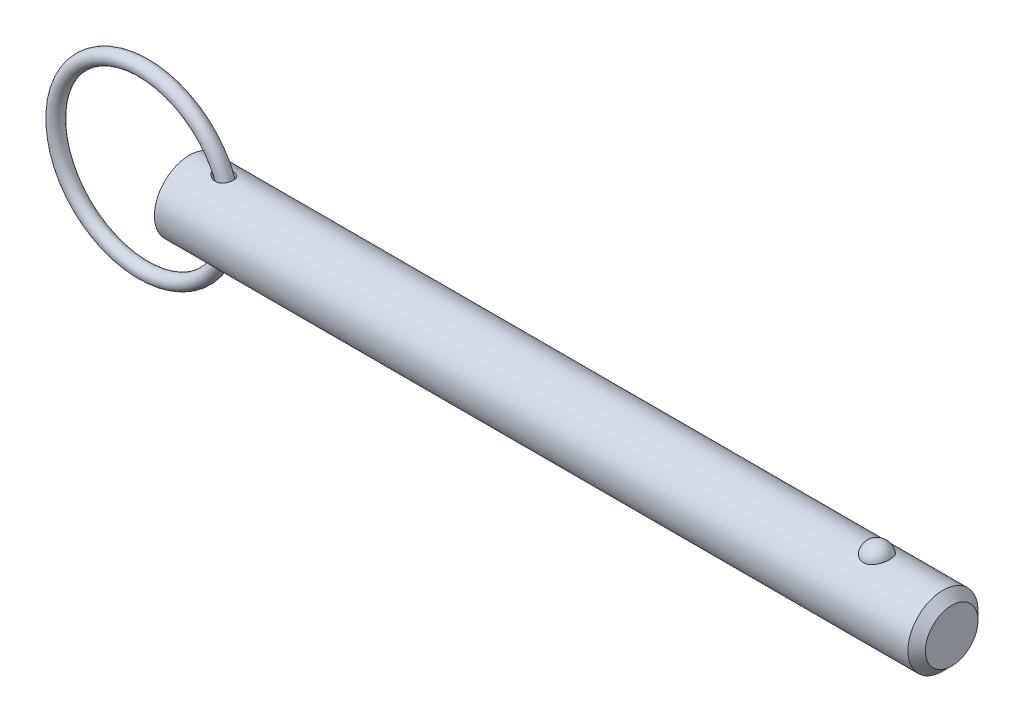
ISO-10303-21;
HEADER;
FILE_DESCRIPTION(('STEP AP214'),'2;1');
FILE_NAME('part.step','',(''),(''),'','','');
FILE_SCHEMA(('AUTOMOTIVE_DESIGN { 1 0 10303 214 1 1 1 1 }'));
ENDSEC;
DATA;
#1=APPLICATION_CONTEXT('core data for automotive mechanical design processes');
#2=APPLICATION_PROTOCOL_DEFINITION('international standard','automotive_design',2000,#1);
#3=PRODUCT_CONTEXT('',#1,'mechanical');
#4=PRODUCT('Part','Part','',(#3));
#5=PRODUCT_RELATED_PRODUCT_CATEGORY('part','',(#4));
#6=PRODUCT_DEFINITION_FORMATION('','',#4);
#7=PRODUCT_DEFINITION_CONTEXT('part definition',#1,'design');
#8=PRODUCT_DEFINITION('design','',#6,#7);
#9=PRODUCT_DEFINITION_SHAPE('','',#8);
#10=(LENGTH_UNIT() NAMED_UNIT(*) SI_UNIT(.MILLI.,.METRE.));
#11=(NAMED_UNIT(*) PLANE_ANGLE_UNIT() SI_UNIT($,.RADIAN.));
#12=(NAMED_UNIT(*) SI_UNIT($,.STERADIAN.) SOLID_ANGLE_UNIT());
#13=UNCERTAINTY_MEASURE_WITH_UNIT(LENGTH_MEASURE(1.E-05),#10,'distance_accuracy_value','');
#14=(GEOMETRIC_REPRESENTATION_CONTEXT(3) GLOBAL_UNCERTAINTY_ASSIGNED_CONTEXT((#13)) GLOBAL_UNIT_ASSIGNED_CONTEXT((#10,
#11,#12)) REPRESENTATION_CONTEXT('',''));
#15=CARTESIAN_POINT('',(0.,0.,0.));
#16=DIRECTION('',(0.,0.,1.));
#17=DIRECTION('',(1.,0.,0.));
#18=AXIS2_PLACEMENT_3D('',#15,#16,#17);
#19=CARTESIAN_POINT('',(-8.34703434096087,0.,0.));
#20=DIRECTION('',(0.,0.,1.));
#21=DIRECTION('',(1.,0.,0.));
#22=AXIS2_PLACEMENT_3D('',#19,#20,#21);
#23=TOROIDAL_SURFACE('',#22,15.875,1.27);
#24=CARTESIAN_POINT('',(8.79796565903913,0.,0.));
#25=VERTEX_POINT('',#24);
#26=VERTEX_LOOP('',#25);
#27=FACE_BOUND('',#26,.T.);
#28=ADVANCED_FACE('P0_F12',(#27),#23,.T.);
#29=CLOSED_SHELL('',(#28));
#30=MANIFOLD_SOLID_BREP('P0_B1',#29);
#31=CARTESIAN_POINT('',(0.,0.,0.));
#32=DIRECTION('',(1.,0.,0.));
#33=DIRECTION('',(0.,0.,-1.));
#34=AXIS2_PLACEMENT_3D('',#31,#32,#33);
#35=CYLINDRICAL_SURFACE('',#34,6.35);
#36=CARTESIAN_POINT('',(4.87230670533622,6.27273159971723,-0.987592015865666));
#37=CARTESIAN_POINT('',(4.94734735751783,6.26035058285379,-1.06623378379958));
#38=CARTESIAN_POINT('',(5.02968768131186,6.24755813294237,-1.13788608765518));
#39=CARTESIAN_POINT('',(5.2053426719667,6.22278258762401,-1.26640223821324));
#40=CARTESIAN_POINT('',(5.29867273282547,6.21080066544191,-1.32324497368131));
#41=CARTESIAN_POINT('',(5.49318962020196,6.18912414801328,-1.42117930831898));
#42=CARTESIAN_POINT('',(5.59435470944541,6.17942350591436,-1.46231273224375));
#43=CARTESIAN_POINT('',(5.80219659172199,6.16352555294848,-1.52793951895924));
#44=CARTESIAN_POINT('',(5.90887152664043,6.15732706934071,-1.55243845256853));
#45=CARTESIAN_POINT('',(6.12818220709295,6.14931784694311,-1.58387975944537));
#46=CARTESIAN_POINT('',(6.24090110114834,6.14763959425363,-1.59029227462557));
#47=CARTESIAN_POINT('',(6.46560233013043,6.14965588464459,-1.58248630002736));
#48=CARTESIAN_POINT('',(6.57758514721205,6.15334646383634,-1.56828303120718));
#49=CARTESIAN_POINT('',(6.78516594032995,6.1652116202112,-1.52091398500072));
#50=CARTESIAN_POINT('',(6.88126802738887,6.17288876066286,-1.48983713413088));
#51=CARTESIAN_POINT('',(7.06576629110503,6.19149190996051,-1.41052329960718));
#52=CARTESIAN_POINT('',(7.15416739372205,6.20241582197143,-1.36229738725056));
#53=CARTESIAN_POINT('',(7.31166929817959,6.2248616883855,-1.25548983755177));
#54=CARTESIAN_POINT('',(7.3818144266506,6.23621734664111,-1.19840625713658));
#55=CARTESIAN_POINT('',(7.51101296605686,6.259037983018,-1.07284763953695));
#56=CARTESIAN_POINT('',(7.57006844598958,6.2705029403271,-1.00437473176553));
#57=CARTESIAN_POINT('',(7.6737469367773,6.29184873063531,-0.860384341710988));
#58=CARTESIAN_POINT('',(7.71876694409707,6.30176816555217,-0.785157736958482));
#59=CARTESIAN_POINT('',(7.79574491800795,6.31935829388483,-0.628053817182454));
#60=CARTESIAN_POINT('',(7.82770308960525,6.32702902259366,-0.546176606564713));
#61=CARTESIAN_POINT('',(7.87788845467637,6.33930929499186,-0.377876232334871));
#62=CARTESIAN_POINT('',(7.89608106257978,6.34391112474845,-0.291442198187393));
#63=CARTESIAN_POINT('',(7.9182072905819,6.34953044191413,-0.116652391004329));
#64=CARTESIAN_POINT('',(7.92214044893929,6.35054781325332,-0.0282965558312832));
#65=CARTESIAN_POINT('',(7.91564686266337,6.34888556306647,0.148263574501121));
#66=CARTESIAN_POINT('',(7.90515337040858,6.34618875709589,0.236465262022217));
#67=CARTESIAN_POINT('',(7.8699153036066,6.33735741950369,0.409798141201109));
#68=CARTESIAN_POINT('',(7.84517062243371,6.33122286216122,0.494929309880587));
#69=CARTESIAN_POINT('',(7.7819985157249,6.31618517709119,0.659657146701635));
#70=CARTESIAN_POINT('',(7.74357645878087,6.30728313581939,0.739255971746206));
#71=CARTESIAN_POINT('',(7.65396632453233,6.28769050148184,0.890663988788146));
#72=CARTESIAN_POINT('',(7.60277911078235,6.27700002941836,0.962473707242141));
#73=CARTESIAN_POINT('',(7.48925881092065,6.2550822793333,1.09590260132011));
#74=CARTESIAN_POINT('',(7.42698604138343,6.24385813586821,1.15757361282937));
#75=CARTESIAN_POINT('',(7.29283556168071,6.2220655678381,1.26951234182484));
#76=CARTESIAN_POINT('',(7.22095880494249,6.21149707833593,1.31978118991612));
#77=CARTESIAN_POINT('',(7.06971853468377,6.19216002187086,1.40772509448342));
#78=CARTESIAN_POINT('',(6.99035873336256,6.18339056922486,1.44540635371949));
#79=CARTESIAN_POINT('',(6.82642723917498,6.16851603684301,1.50762653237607));
#80=CARTESIAN_POINT('',(6.7418548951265,6.16241129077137,1.53216380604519));
#81=CARTESIAN_POINT('',(6.56686412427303,6.15321474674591,1.56869994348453));
#82=CARTESIAN_POINT('',(6.47634467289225,6.15023369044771,1.58023897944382));
#83=CARTESIAN_POINT('',(6.29456956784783,6.14778331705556,1.58974172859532));
#84=CARTESIAN_POINT('',(6.20331368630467,6.1483151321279,1.58770106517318));
#85=CARTESIAN_POINT('',(6.01385969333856,6.15284811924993,1.5700487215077));
#86=CARTESIAN_POINT('',(5.91578322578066,6.15715979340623,1.55322212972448));
#87=CARTESIAN_POINT('',(5.72331909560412,6.16902415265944,1.5054032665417));
#88=CARTESIAN_POINT('',(5.6289344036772,6.17657939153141,1.4743998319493));
#89=CARTESIAN_POINT('',(5.4357260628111,6.19502494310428,1.39499475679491));
#90=CARTESIAN_POINT('',(5.33755891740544,6.20619097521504,1.34505268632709));
#91=CARTESIAN_POINT('',(5.15090047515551,6.23006191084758,1.22975103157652));
#92=CARTESIAN_POINT('',(5.06240741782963,6.24276653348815,1.16439425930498));
#93=CARTESIAN_POINT('',(4.91171642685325,6.26607433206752,1.03083814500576));
#94=CARTESIAN_POINT('',(4.84758224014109,6.27668356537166,0.964825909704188));
#95=CARTESIAN_POINT('',(4.73090054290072,6.29683133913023,0.823112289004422));
#96=CARTESIAN_POINT('',(4.67833688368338,6.30637136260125,0.747424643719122));
#97=CARTESIAN_POINT('',(4.59543145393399,6.32183254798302,0.601150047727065));
#98=CARTESIAN_POINT('',(4.56283099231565,6.32809321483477,0.531883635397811));
#99=CARTESIAN_POINT('',(4.50941370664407,6.33849198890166,0.388778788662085));
#100=CARTESIAN_POINT('',(4.48858876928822,6.34263155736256,0.314943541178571));
#101=CARTESIAN_POINT('',(4.46008864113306,6.3483236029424,0.164282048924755));
#102=CARTESIAN_POINT('',(4.45247558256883,6.34986385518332,0.08744340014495));
#103=CARTESIAN_POINT('',(4.45121096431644,6.35011863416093,-0.0663538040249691));
#104=CARTESIAN_POINT('',(4.45755802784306,6.34883343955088,-0.143312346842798));
#105=CARTESIAN_POINT('',(4.48267656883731,6.34380948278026,-0.288945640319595));
#106=CARTESIAN_POINT('',(4.50045680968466,6.34026665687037,-0.357802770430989));
#107=CARTESIAN_POINT('',(4.54636050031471,6.33128211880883,-0.491815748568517));
#108=CARTESIAN_POINT('',(4.57448566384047,6.32584009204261,-0.556970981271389));
#109=CARTESIAN_POINT('',(4.64209700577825,6.31308107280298,-0.687092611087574));
#110=CARTESIAN_POINT('',(4.68226903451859,6.30565525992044,-0.751689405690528));
#111=CARTESIAN_POINT('',(4.77120834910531,6.28979741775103,-0.874524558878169));
#112=CARTESIAN_POINT('',(4.81998302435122,6.28136452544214,-0.932757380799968));
#113=CARTESIAN_POINT('',(4.87230670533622,6.27273159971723,-0.987592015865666));
#114=B_SPLINE_CURVE_WITH_KNOTS('',3,(#36,#37,#38,#39,#40,#41,#42,#43,#44,#45,#46,#47,#48,#49,
#50,#51,#52,#53,#54,#55,#56,#57,#58,#59,#60,#61,#62,#63,#64,#65,#66,#67,#68,#69,#70,#71,#72,#73,
#74,#75,#76,#77,#78,#79,#80,#81,#82,#83,#84,#85,#86,#87,#88,#89,#90,#91,#92,#93,#94,#95,#96,#97,
#98,#99,#100,#101,#102,#103,#104,#105,#106,#107,#108,#109,#110,#111,#112,#113),.UNSPECIFIED.,
.T.,.F.,(4,2,2,2,2,2,2,2,2,2,2,2,2,2,2,2,2,2,2,2,2,2,2,2,2,2,2,2,2,2,2,2,2,2,2,2,2,2,4),(0.,
0.327902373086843,0.65626964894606,0.983756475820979,1.31113357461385,1.64800657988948,
1.98463099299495,2.28681225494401,2.58879878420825,2.86088594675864,3.13292229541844,
3.3963648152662,3.65980320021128,3.92390128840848,4.18800792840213,4.45334062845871,
4.7186753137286,4.98390596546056,5.24911867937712,5.51293017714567,5.7767155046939,
6.04037065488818,6.30405880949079,6.57680801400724,6.84964512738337,7.14724526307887,
7.44508014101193,7.77572668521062,8.10631295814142,8.38318772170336,8.65967357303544,
8.88915303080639,9.11847418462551,9.34887088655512,9.57924486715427,9.79193291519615,
10.0046562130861,10.2330958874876,10.4617327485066),.UNSPECIFIED.);
#115=CARTESIAN_POINT('',(4.87230670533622,6.27273159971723,-0.987592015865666));
#116=VERTEX_POINT('',#115);
#117=EDGE_CURVE('P1_E40',#116,#116,#114,.T.);
#118=ORIENTED_EDGE('',*,*,#117,.T.);
#119=EDGE_LOOP('',(#118));
#120=FACE_BOUND('',#119,.T.);
#121=CARTESIAN_POINT('',(136.5125,0.,0.));
#122=DIRECTION('',(1.,0.,0.));
#123=DIRECTION('',(0.,0.,-1.));
#124=AXIS2_PLACEMENT_3D('',#121,#122,#123);
#125=CIRCLE('',#124,6.35);
#126=CARTESIAN_POINT('',(136.5125,0.,-6.35));
#127=VERTEX_POINT('',#126);
#128=EDGE_CURVE('P1_E25',#127,#127,#125,.T.);
#129=ORIENTED_EDGE('',*,*,#128,.F.);
#130=EDGE_LOOP('',(#129));
#131=FACE_BOUND('',#130,.T.);
#132=CARTESIAN_POINT('',(0.,0.,0.));
#133=DIRECTION('',(1.,0.,0.));
#134=DIRECTION('',(0.,0.,-1.));
#135=AXIS2_PLACEMENT_3D('',#132,#133,#134);
#136=CIRCLE('',#135,6.35);
#137=CARTESIAN_POINT('',(0.,0.,-6.35));
#138=VERTEX_POINT('',#137);
#139=EDGE_CURVE('P1_E9',#138,#138,#136,.T.);
#140=ORIENTED_EDGE('',*,*,#139,.T.);
#141=EDGE_LOOP('',(#140));
#142=FACE_BOUND('',#141,.T.);
#143=CARTESIAN_POINT('',(124.550021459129,5.87502187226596,2.40969251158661));
#144=CARTESIAN_POINT('',(124.425030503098,5.87501645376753,2.40969773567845));
#145=CARTESIAN_POINT('',(124.300080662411,5.87916061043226,2.39967292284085));
#146=CARTESIAN_POINT('',(124.053909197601,5.8952311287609,2.35991730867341));
#147=CARTESIAN_POINT('',(123.932686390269,5.90715499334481,2.33019283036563));
#148=CARTESIAN_POINT('',(123.697517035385,5.93739567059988,2.252014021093));
#149=CARTESIAN_POINT('',(123.583560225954,5.95570321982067,2.20358681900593));
#150=CARTESIAN_POINT('',(123.36557352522,5.9967206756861,2.08937987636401));
#151=CARTESIAN_POINT('',(123.261545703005,6.0194314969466,2.02359652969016));
#152=CARTESIAN_POINT('',(123.062943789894,6.06760647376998,1.87428969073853));
#153=CARTESIAN_POINT('',(122.968726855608,6.09313095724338,1.79031110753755));
#154=CARTESIAN_POINT('',(122.795255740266,6.14375873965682,1.60800178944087));
#155=CARTESIAN_POINT('',(122.716004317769,6.16886196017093,1.50966841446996));
#156=CARTESIAN_POINT('',(122.570845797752,6.21724600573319,1.29645884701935));
#157=CARTESIAN_POINT('',(122.505688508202,6.24039621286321,1.18104158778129));
#158=CARTESIAN_POINT('',(122.394703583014,6.28117277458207,0.940351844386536));
#159=CARTESIAN_POINT('',(122.348877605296,6.29879865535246,0.815078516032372));
#160=CARTESIAN_POINT('',(122.277023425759,6.32692073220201,0.556494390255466));
#161=CARTESIAN_POINT('',(122.251249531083,6.33732517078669,0.423102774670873));
#162=CARTESIAN_POINT('',(122.220988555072,6.34957673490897,0.153542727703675));
#163=CARTESIAN_POINT('',(122.216500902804,6.35142408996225,0.0173743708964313));
#164=CARTESIAN_POINT('',(122.228865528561,6.34638925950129,-0.253036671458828));
#165=CARTESIAN_POINT('',(122.245594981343,6.33955731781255,-0.387285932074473));
#166=CARTESIAN_POINT('',(122.299843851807,6.31794129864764,-0.650851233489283));
#167=CARTESIAN_POINT('',(122.337363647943,6.30315707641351,-0.780167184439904));
#168=CARTESIAN_POINT('',(122.432500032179,6.26711642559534,-1.03041949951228));
#169=CARTESIAN_POINT('',(122.490143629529,6.24585130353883,-1.15134433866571));
#170=CARTESIAN_POINT('',(122.624352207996,6.19905619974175,-1.38129800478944));
#171=CARTESIAN_POINT('',(122.700918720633,6.17352587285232,-1.49032586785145));
#172=CARTESIAN_POINT('',(122.871753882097,6.12080227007,-1.69393164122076));
#173=CARTESIAN_POINT('',(122.966100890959,6.09360200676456,-1.78844209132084));
#174=CARTESIAN_POINT('',(123.170119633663,6.04070434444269,-1.95970536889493));
#175=CARTESIAN_POINT('',(123.279790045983,6.01500681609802,-2.03645972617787));
#176=CARTESIAN_POINT('',(123.509187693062,5.96867714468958,-2.16845644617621));
#177=CARTESIAN_POINT('',(123.628652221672,5.94794910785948,-2.22412062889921));
#178=CARTESIAN_POINT('',(123.876218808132,5.91340580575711,-2.31440992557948));
#179=CARTESIAN_POINT('',(124.004317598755,5.89958794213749,-2.34904294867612));
#180=CARTESIAN_POINT('',(124.258582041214,5.88111049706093,-2.39491590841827));
#181=CARTESIAN_POINT('',(124.384520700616,5.87602512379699,-2.4072451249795));
#182=CARTESIAN_POINT('',(124.636786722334,5.87428980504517,-2.41147867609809));
#183=CARTESIAN_POINT('',(124.763114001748,5.87763817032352,-2.40338710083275));
#184=CARTESIAN_POINT('',(125.008417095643,5.89212921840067,-2.36762715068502));
#185=CARTESIAN_POINT('',(125.127499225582,5.90302431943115,-2.34058030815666));
#186=CARTESIAN_POINT('',(125.35924472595,5.93113752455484,-2.26839066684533));
#187=CARTESIAN_POINT('',(125.471907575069,5.94835614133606,-2.2232464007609));
#188=CARTESIAN_POINT('',(125.690400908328,5.98773016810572,-2.11493806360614));
#189=CARTESIAN_POINT('',(125.796028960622,6.00998499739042,-2.05140269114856));
#190=CARTESIAN_POINT('',(125.995300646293,6.05690144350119,-1.90842705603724));
#191=CARTESIAN_POINT('',(126.088941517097,6.08156361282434,-1.82898313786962));
#192=CARTESIAN_POINT('',(126.266675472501,6.13211715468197,-1.65182429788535));
#193=CARTESIAN_POINT('',(126.350055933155,6.15800825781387,-1.55339381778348));
#194=CARTESIAN_POINT('',(126.499790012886,6.20712834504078,-1.34374214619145));
#195=CARTESIAN_POINT('',(126.566140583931,6.23035685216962,-1.23251867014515));
#196=CARTESIAN_POINT('',(126.682345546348,6.27251177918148,-0.996447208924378));
#197=CARTESIAN_POINT('',(126.731607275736,6.29127762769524,-0.871278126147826));
#198=CARTESIAN_POINT('',(126.809614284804,6.3215862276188,-0.613870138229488));
#199=CARTESIAN_POINT('',(126.838359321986,6.33312889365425,-0.481631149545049));
#200=CARTESIAN_POINT('',(126.87477058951,6.34782349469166,-0.213672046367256));
#201=CARTESIAN_POINT('',(126.882413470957,6.35096613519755,-0.0779482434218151));
#202=CARTESIAN_POINT('',(126.876395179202,6.34851322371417,0.192943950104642));
#203=CARTESIAN_POINT('',(126.862734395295,6.3429178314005,0.328112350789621));
#204=CARTESIAN_POINT('',(126.81450361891,6.32360512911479,0.593406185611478));
#205=CARTESIAN_POINT('',(126.780031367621,6.30992579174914,0.7235521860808));
#206=CARTESIAN_POINT('',(126.690953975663,6.27586325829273,0.975834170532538));
#207=CARTESIAN_POINT('',(126.63634761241,6.25547965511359,1.09796966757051));
#208=CARTESIAN_POINT('',(126.50775879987,6.20998183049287,1.33148921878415));
#209=CARTESIAN_POINT('',(126.433674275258,6.18484288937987,1.44281227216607));
#210=CARTESIAN_POINT('',(126.267820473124,6.13258735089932,1.65087683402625));
#211=CARTESIAN_POINT('',(126.176051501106,6.10547078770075,1.74761859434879));
#212=CARTESIAN_POINT('',(125.977183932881,6.0523587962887,1.92350926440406));
#213=CARTESIAN_POINT('',(125.870133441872,6.0263601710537,2.00271146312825));
#214=CARTESIAN_POINT('',(125.643138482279,5.97843747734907,2.14154159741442));
#215=CARTESIAN_POINT('',(125.523191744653,5.95651412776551,2.20116608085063));
#216=CARTESIAN_POINT('',(125.264523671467,5.91812106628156,2.30250570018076));
#217=CARTESIAN_POINT('',(125.12506980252,5.90217533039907,2.342567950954));
#218=CARTESIAN_POINT('',(124.840397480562,5.88063128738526,2.39615214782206));
#219=CARTESIAN_POINT('',(124.69518174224,5.8750281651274,2.40968644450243));
#220=CARTESIAN_POINT('',(124.550021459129,5.87502187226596,2.40969251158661));
#221=B_SPLINE_CURVE_WITH_KNOTS('',3,(#143,#144,#145,#146,#147,#148,#149,#150,#151,#152,#153,
#154,#155,#156,#157,#158,#159,#160,#161,#162,#163,#164,#165,#166,#167,#168,#169,#170,#171,#172,
#173,#174,#175,#176,#177,#178,#179,#180,#181,#182,#183,#184,#185,#186,#187,#188,#189,#190,#191,
#192,#193,#194,#195,#196,#197,#198,#199,#200,#201,#202,#203,#204,#205,#206,#207,#208,#209,#210,
#211,#212,#213,#214,#215,#216,#217,#218,#219,#220),.UNSPECIFIED.,.T.,.F.,(4,2,2,2,2,2,2,2,2,2,2,
2,2,2,2,2,2,2,2,2,2,2,2,2,2,2,2,2,2,2,2,2,2,2,2,2,2,2,4),(0.,0.374440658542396,
0.748761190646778,1.12254078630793,1.49639810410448,1.88098871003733,2.26565013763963,
2.66741104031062,3.06920639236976,3.47601794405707,3.88281858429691,4.28727498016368,
4.69173873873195,5.09674745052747,5.50178895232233,5.90865911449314,6.31549420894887,
6.7136985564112,7.11175305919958,7.4897807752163,7.86773278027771,8.23383886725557,
8.59997464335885,8.97409044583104,9.34829231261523,9.74122667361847,10.1342313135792,
10.5397522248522,10.9452779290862,11.3512521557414,11.7572189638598,12.1612938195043,
12.5653932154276,12.9716540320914,13.3779078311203,13.7829098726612,14.1879832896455,
14.6230486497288,15.057911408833),.UNSPECIFIED.);
#222=CARTESIAN_POINT('',(124.550021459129,5.87502187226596,2.40969251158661));
#223=VERTEX_POINT('',#222);
#224=EDGE_CURVE('P1_E34',#223,#223,#221,.T.);
#225=ORIENTED_EDGE('',*,*,#224,.T.);
#226=EDGE_LOOP('',(#225));
#227=FACE_BOUND('',#226,.T.);
#228=CARTESIAN_POINT('',(4.87230670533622,-6.27273159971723,-0.987592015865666));
#229=CARTESIAN_POINT('',(4.81440819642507,-6.28228431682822,-0.926913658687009));
#230=CARTESIAN_POINT('',(4.76085022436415,-6.29159289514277,-0.862071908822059));
#231=CARTESIAN_POINT('',(4.66448472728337,-6.3088950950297,-0.72465504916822));
#232=CARTESIAN_POINT('',(4.62166818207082,-6.31688981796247,-0.652086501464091));
#233=CARTESIAN_POINT('',(4.54882773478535,-6.33076917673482,-0.49974775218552));
#234=CARTESIAN_POINT('',(4.51891553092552,-6.33663532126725,-0.419921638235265));
#235=CARTESIAN_POINT('',(4.47476924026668,-6.3453711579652,-0.255882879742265));
#236=CARTESIAN_POINT('',(4.46051880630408,-6.34824397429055,-0.171674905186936));
#237=CARTESIAN_POINT('',(4.44966179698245,-6.35043041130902,-0.0120763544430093));
#238=CARTESIAN_POINT('',(4.45117530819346,-6.35012328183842,0.0631849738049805));
#239=CARTESIAN_POINT('',(4.46726452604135,-6.34689000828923,0.212230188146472));
#240=CARTESIAN_POINT('',(4.48184026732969,-6.3439638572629,0.286014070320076));
#241=CARTESIAN_POINT('',(4.52202068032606,-6.33603071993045,0.426550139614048));
#242=CARTESIAN_POINT('',(4.54707079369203,-6.33112875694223,0.493469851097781));
#243=CARTESIAN_POINT('',(4.6066985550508,-6.31972370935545,0.622743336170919));
#244=CARTESIAN_POINT('',(4.64127887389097,-6.31322017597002,0.685095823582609));
#245=CARTESIAN_POINT('',(4.72328142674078,-6.29826068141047,0.811769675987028));
#246=CARTESIAN_POINT('',(4.77176118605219,-6.28966287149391,0.875386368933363));
#247=CARTESIAN_POINT('',(4.87703902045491,-6.27182325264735,0.99519278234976));
#248=CARTESIAN_POINT('',(4.93384225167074,-6.26258104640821,1.05137785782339));
#249=CARTESIAN_POINT('',(5.0661743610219,-6.24228878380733,1.16635591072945));
#250=CARTESIAN_POINT('',(5.1431816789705,-6.23124423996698,1.22345054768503));
#251=CARTESIAN_POINT('',(5.30475767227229,-6.21023402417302,1.32598441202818));
#252=CARTESIAN_POINT('',(5.3893323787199,-6.20026922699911,1.37141422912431));
#253=CARTESIAN_POINT('',(5.5776013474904,-6.18099350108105,1.45601817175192));
#254=CARTESIAN_POINT('',(5.68224348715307,-6.17201456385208,1.4931788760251));
#255=CARTESIAN_POINT('',(5.89649087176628,-6.15800474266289,1.5499484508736));
#256=CARTESIAN_POINT('',(6.00609708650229,-6.15297463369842,1.56955387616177));
#257=CARTESIAN_POINT('',(6.22752772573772,-6.14779725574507,1.58971993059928));
#258=CARTESIAN_POINT('',(6.33935715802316,-6.14766266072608,1.59023112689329));
#259=CARTESIAN_POINT('',(6.56108231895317,-6.15269227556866,1.57066564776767));
#260=CARTESIAN_POINT('',(6.67097982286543,-6.15785133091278,1.55060899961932));
#261=CARTESIAN_POINT('',(6.87257705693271,-6.17211580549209,1.4927326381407));
#262=CARTESIAN_POINT('',(6.96494608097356,-6.18072242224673,1.45711948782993));
#263=CARTESIAN_POINT('',(7.14129343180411,-6.20069920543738,1.36960980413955));
#264=CARTESIAN_POINT('',(7.22527609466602,-6.21206793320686,1.31772174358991));
#265=CARTESIAN_POINT('',(7.37471505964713,-6.23497047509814,1.20443359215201));
#266=CARTESIAN_POINT('',(7.44115811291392,-6.24639757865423,1.14430788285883));
#267=CARTESIAN_POINT('',(7.5626186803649,-6.26896339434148,1.0134084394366));
#268=CARTESIAN_POINT('',(7.61763801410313,-6.28010215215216,0.942636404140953));
#269=CARTESIAN_POINT('',(7.71360563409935,-6.30055923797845,0.794304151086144));
#270=CARTESIAN_POINT('',(7.75485562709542,-6.3099143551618,0.716943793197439));
#271=CARTESIAN_POINT('',(7.82406051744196,-6.32610528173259,0.556244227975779));
#272=CARTESIAN_POINT('',(7.8520154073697,-6.33294108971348,0.472905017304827));
#273=CARTESIAN_POINT('',(7.89408663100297,-6.34338077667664,0.302249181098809));
#274=CARTESIAN_POINT('',(7.90814615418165,-6.34697138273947,0.214917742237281));
#275=CARTESIAN_POINT('',(7.92192329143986,-6.35048887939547,0.0390564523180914));
#276=CARTESIAN_POINT('',(7.92164046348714,-6.3504156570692,-0.0494734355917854));
#277=CARTESIAN_POINT('',(7.90670754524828,-6.34660520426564,-0.225592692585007));
#278=CARTESIAN_POINT('',(7.89199989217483,-6.34285329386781,-0.31317687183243));
#279=CARTESIAN_POINT('',(7.8484534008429,-6.33206809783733,-0.484549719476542));
#280=CARTESIAN_POINT('',(7.81961455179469,-6.32503480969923,-0.568338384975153));
#281=CARTESIAN_POINT('',(7.74850591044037,-6.30846389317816,-0.729625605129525));
#282=CARTESIAN_POINT('',(7.70625193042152,-6.29892921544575,-0.807131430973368));
#283=CARTESIAN_POINT('',(7.60933437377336,-6.27840608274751,-0.953731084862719));
#284=CARTESIAN_POINT('',(7.55467181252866,-6.2674177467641,-1.02282560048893));
#285=CARTESIAN_POINT('',(7.43471786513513,-6.24527869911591,-1.15028913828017));
#286=CARTESIAN_POINT('',(7.36948829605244,-6.23412925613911,-1.20871657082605));
#287=CARTESIAN_POINT('',(7.23001723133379,-6.21283678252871,-1.3137894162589));
#288=CARTESIAN_POINT('',(7.15577649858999,-6.20269366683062,-1.36043582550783));
#289=CARTESIAN_POINT('',(7.00025986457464,-6.18446636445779,-1.4410399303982));
#290=CARTESIAN_POINT('',(6.91896776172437,-6.17638709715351,-1.47496739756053));
#291=CARTESIAN_POINT('',(6.75184232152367,-6.16309237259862,-1.52957024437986));
#292=CARTESIAN_POINT('',(6.66600814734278,-6.15787744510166,-1.55024317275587));
#293=CARTESIAN_POINT('',(6.48842585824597,-6.15055064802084,-1.57906962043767));
#294=CARTESIAN_POINT('',(6.39658108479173,-6.14857915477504,-1.58665744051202));
#295=CARTESIAN_POINT('',(6.2127983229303,-6.14817707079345,-1.58821048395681));
#296=CARTESIAN_POINT('',(6.12086031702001,-6.14974736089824,-1.58217231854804));
#297=CARTESIAN_POINT('',(5.92996902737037,-6.15640095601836,-1.55609403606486));
#298=CARTESIAN_POINT('',(5.83120653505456,-6.16181208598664,-1.53474519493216));
#299=CARTESIAN_POINT('',(5.63804881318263,-6.17573474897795,-1.47771859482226));
#300=CARTESIAN_POINT('',(5.54365953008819,-6.18425037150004,-1.44202192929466));
#301=CARTESIAN_POINT('',(5.34413923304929,-6.20522938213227,-1.34918979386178));
#302=CARTESIAN_POINT('',(5.24033140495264,-6.21813417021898,-1.28928337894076));
#303=CARTESIAN_POINT('',(5.04554233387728,-6.24510162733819,-1.15156760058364));
#304=CARTESIAN_POINT('',(4.9545459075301,-6.25916289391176,-1.07377972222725));
#305=CARTESIAN_POINT('',(4.87230670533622,-6.27273159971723,-0.987592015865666));
#306=B_SPLINE_CURVE_WITH_KNOTS('',3,(#228,#229,#230,#231,#232,#233,#234,#235,#236,#237,#238,
#239,#240,#241,#242,#243,#244,#245,#246,#247,#248,#249,#250,#251,#252,#253,#254,#255,#256,#257,
#258,#259,#260,#261,#262,#263,#264,#265,#266,#267,#268,#269,#270,#271,#272,#273,#274,#275,#276,
#277,#278,#279,#280,#281,#282,#283,#284,#285,#286,#287,#288,#289,#290,#291,#292,#293,#294,#295,
#296,#297,#298,#299,#300,#301,#302,#303,#304,#305),.UNSPECIFIED.,.T.,.F.,(4,2,2,2,2,2,2,2,2,2,2,
2,2,2,2,2,2,2,2,2,2,2,2,2,2,2,2,2,2,2,2,2,2,2,2,2,2,2,4),(0.,0.252951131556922,
0.505689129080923,0.760572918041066,1.01519041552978,1.23982791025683,1.46446600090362,
1.67847364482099,1.89254132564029,2.13299551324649,2.37359928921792,2.6619896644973,
2.95061196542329,3.28329078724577,3.61603488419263,3.9496403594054,4.28292130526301,
4.57939201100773,4.87570862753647,5.14538810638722,5.41502459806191,5.67829123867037,
5.94155802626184,6.20589676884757,6.47024365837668,6.73564974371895,7.00105603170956,
7.26615064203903,7.53122356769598,7.79479837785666,8.05835088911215,8.32252586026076,
8.58674967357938,8.86213419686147,9.137587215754,9.43991696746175,9.74264642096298,
10.1023688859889,10.461661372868),.UNSPECIFIED.);
#307=CARTESIAN_POINT('',(4.87230670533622,-6.27273159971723,-0.987592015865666));
#308=VERTEX_POINT('',#307);
#309=EDGE_CURVE('P1_E17',#308,#308,#306,.T.);
#310=ORIENTED_EDGE('',*,*,#309,.T.);
#311=EDGE_LOOP('',(#310));
#312=FACE_BOUND('',#311,.T.);
#313=ADVANCED_FACE('P1_F13',(#120,#131,#142,#227,#312),#35,.T.);
#314=CARTESIAN_POINT('',(0.,0.,0.));
#315=DIRECTION('',(-1.,0.,0.));
#316=DIRECTION('',(0.,0.,1.));
#317=AXIS2_PLACEMENT_3D('',#314,#315,#316);
#318=PLANE('',#317);
#319=ORIENTED_EDGE('',*,*,#139,.F.);
#320=EDGE_LOOP('',(#319));
#321=FACE_BOUND('',#320,.T.);
#322=ADVANCED_FACE('P1_F15',(#321),#318,.T.);
#323=CARTESIAN_POINT('',(138.1,0.,0.));
#324=DIRECTION('',(-1.,0.,0.));
#325=DIRECTION('',(0.,0.,1.));
#326=AXIS2_PLACEMENT_3D('',#323,#324,#325);
#327=CONICAL_SURFACE('',#326,4.76250000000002,0.785398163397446);
#328=ORIENTED_EDGE('',*,*,#128,.T.);
#329=EDGE_LOOP('',(#328));
#330=FACE_BOUND('',#329,.T.);
#331=CARTESIAN_POINT('',(138.1,0.,0.));
#332=DIRECTION('',(1.,0.,0.));
#333=DIRECTION('',(0.,0.,-1.));
#334=AXIS2_PLACEMENT_3D('',#331,#332,#333);
#335=CIRCLE('',#334,4.76250000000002);
#336=CARTESIAN_POINT('',(138.1,0.,-4.76250000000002));
#337=VERTEX_POINT('',#336);
#338=EDGE_CURVE('P1_E30',#337,#337,#335,.T.);
#339=ORIENTED_EDGE('',*,*,#338,.F.);
#340=EDGE_LOOP('',(#339));
#341=FACE_BOUND('',#340,.T.);
#342=ADVANCED_FACE('P1_F55',(#330,#341),#327,.T.);
#343=CARTESIAN_POINT('',(138.1,4.76250000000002,0.));
#344=DIRECTION('',(1.,0.,0.));
#345=DIRECTION('',(0.,0.,-1.));
#346=AXIS2_PLACEMENT_3D('',#343,#344,#345);
#347=PLANE('',#346);
#348=ORIENTED_EDGE('',*,*,#338,.T.);
#349=EDGE_LOOP('',(#348));
#350=FACE_BOUND('',#349,.T.);
#351=ADVANCED_FACE('P1_F51',(#350),#347,.T.);
#352=CARTESIAN_POINT('',(124.550021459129,5.715,0.));
#353=DIRECTION('',(-1.,0.,0.));
#354=DIRECTION('',(0.,1.,0.));
#355=AXIS2_PLACEMENT_3D('',#352,#353,#354);
#356=SPHERICAL_SURFACE('',#355,2.41500000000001);
#357=ORIENTED_EDGE('',*,*,#224,.F.);
#358=EDGE_LOOP('',(#357));
#359=FACE_BOUND('',#358,.T.);
#360=ADVANCED_FACE('P1_F46',(#359),#356,.T.);
#361=CARTESIAN_POINT('',(-8.34703434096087,0.,0.));
#362=DIRECTION('',(0.,0.,1.));
#363=DIRECTION('',(1.,0.,0.));
#364=AXIS2_PLACEMENT_3D('',#361,#362,#363);
#365=TOROIDAL_SURFACE('',#364,15.875,1.5875);
#366=ORIENTED_EDGE('',*,*,#309,.F.);
#367=EDGE_LOOP('',(#366));
#368=FACE_BOUND('',#367,.T.);
#369=ORIENTED_EDGE('',*,*,#117,.F.);
#370=EDGE_LOOP('',(#369));
#371=FACE_BOUND('',#370,.T.);
#372=ADVANCED_FACE('P1_F50',(#368,#371),#365,.F.);
#373=CLOSED_SHELL('',(#313,#322,#342,#351,#360,#372));
#374=MANIFOLD_SOLID_BREP('P1_B1',#373);
#375=ADVANCED_BREP_SHAPE_REPRESENTATION('',(#18,#30,#374),#14);
#376=SHAPE_DEFINITION_REPRESENTATION(#9,#375);
ENDSEC;
END-ISO-10303-21;
